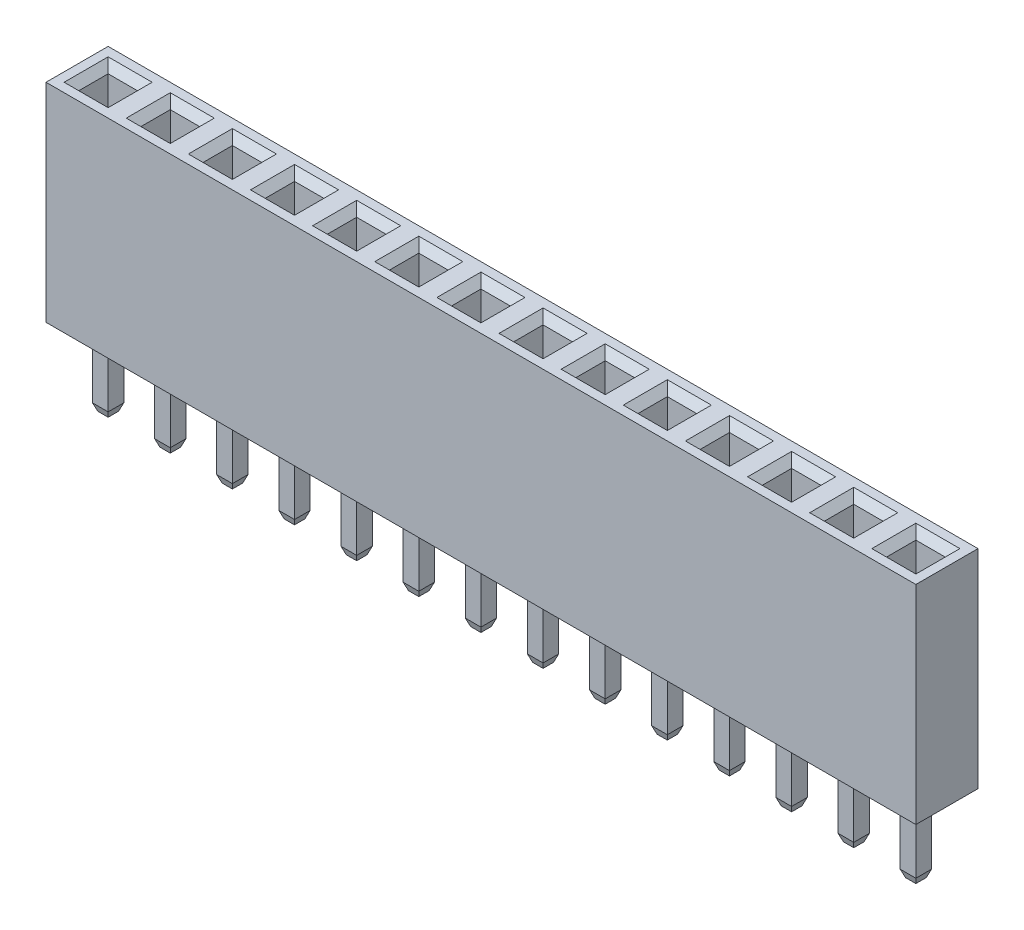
from build123d import *
from OCP.BRepFilletAPI import BRepFilletAPI_MakeChamfer

# Parameters (mm, degrees)
SKETCH_2_W                          = 2.54
SKETCH_2_H                          = 2.54
EXTRUDE_2_DEPTH                     = 8.5
SKETCH_3_W                          = 1.2
SKETCH_3_H                          = 1.2
CUT_EXTRUDE_1_DEPTH                 = 6.2
CHAMFER_3_SIZE                      = 0.3
SKETCH_1_W                          = 0.64
SKETCH_1_H                          = 0.64
EXTRUDE_1_DEPTH                     = 3.15
CHAMFER_1_SIZE                      = 0.3
CHAMFER_1_SIZE2                     = 0.10919107
PATTERN_LINEAR_1_COUNT              = 14
PATTERN_LINEAR_1_PITCH              = 2.54
CHAMFER_3_OF_PATTERN_LINEAR_1_SIZE  = 0.3
PATTERN_LINEAR_2_COUNT              = 60
PATTERN_LINEAR_2_PITCH              = 2.54
CHAMFER_1_OF_PATTERN_LINEAR_2_SIZE  = 0.3
CHAMFER_1_OF_PATTERN_LINEAR_2_SIZE2 = 0.10919107


with BuildPart() as part:
    # Sketch 2 → Extrude 2 (new body)
    with BuildSketch(Plane(origin=(0, 0, 0), x_dir=(1, 0, 0), z_dir=(0, 1, 0))):
        Rectangle(SKETCH_2_W, SKETCH_2_H)
    extrude_2 = extrude(amount=EXTRUDE_2_DEPTH)

    # Sketch 3 → Cut-Extrude 1 (cut)
    with BuildSketch(Plane(origin=(0, 8.5, 0), x_dir=(-1, 0, 0), z_dir=(0, 1, 0))):
        Rectangle(SKETCH_3_W, SKETCH_3_H)
    cut_extrude_1 = extrude(amount=-CUT_EXTRUDE_1_DEPTH, mode=Mode.SUBTRACT)

    # Chamfer 3
    chamfer_3_edges = [part.edges().sort_by_distance(p)[0] for p in [
        (-0.6, 8.5, 0),
        (0, 8.5, 0.6),
        (0.6, 8.5, 0),
        (0, 8.5, -0.6),
    ]]
    chamfer(chamfer_3_edges, length=CHAMFER_3_SIZE)

    # Sketch 1 → Extrude 1 (add)
    with BuildSketch(Plane(origin=(0, 0, 0), x_dir=(1, 0, 0), z_dir=(0, 1, 0))):
        Rectangle(SKETCH_1_W, SKETCH_1_H)
    extrude_1 = extrude(amount=-EXTRUDE_1_DEPTH)

    # Chamfer 1: one chamfer whose edges measure the first distance from different faces: ONE call of the kernel's chamfer builder (chamfer() names one face for all edges)
    chamfer_1_edges_1 = [part.edges().sort_by_distance(p)[0] for p in [
        (-0.32, -3.15, 0),
    ]]
    chamfer_1_side_1 = [part.faces().sort_by_distance(p)[0] for p in [
        (-0.32, -1.575, 0),
    ]]
    chamfer_1_edges_2 = [part.edges().sort_by_distance(p)[0] for p in [
        (0, -3.15, -0.32),
    ]]
    chamfer_1_side_2 = [part.faces().sort_by_distance(p)[0] for p in [
        (0, -1.575, -0.32),
    ]]
    chamfer_1_edges_3 = [part.edges().sort_by_distance(p)[0] for p in [
        (0.32, -3.15, 0),
    ]]
    chamfer_1_side_3 = [part.faces().sort_by_distance(p)[0] for p in [
        (0.32, -1.575, 0),
    ]]
    chamfer_1_edges_4 = [part.edges().sort_by_distance(p)[0] for p in [
        (0, -3.15, 0.32),
    ]]
    chamfer_1_side_4 = [part.faces().sort_by_distance(p)[0] for p in [
        (0, -1.575, 0.32),
    ]]
    chamfer_1 = BRepFilletAPI_MakeChamfer(part.part.solid().wrapped)
    for e in chamfer_1_edges_1:
        chamfer_1.Add(CHAMFER_1_SIZE, CHAMFER_1_SIZE2, e.wrapped, chamfer_1_side_1[0].wrapped)  # the first distance lies on this face
    for e in chamfer_1_edges_2:
        chamfer_1.Add(CHAMFER_1_SIZE, CHAMFER_1_SIZE2, e.wrapped, chamfer_1_side_2[0].wrapped)  # the first distance lies on this face
    for e in chamfer_1_edges_3:
        chamfer_1.Add(CHAMFER_1_SIZE, CHAMFER_1_SIZE2, e.wrapped, chamfer_1_side_3[0].wrapped)  # the first distance lies on this face
    for e in chamfer_1_edges_4:
        chamfer_1.Add(CHAMFER_1_SIZE, CHAMFER_1_SIZE2, e.wrapped, chamfer_1_side_4[0].wrapped)  # the first distance lies on this face
    add(Compound.cast(chamfer_1.Shape()), mode=Mode.REPLACE)

    # Pattern Linear 1: Extrude 2, Cut-Extrude 1 ×14
    with Locations(*[(-i * PATTERN_LINEAR_1_PITCH, 0, 0) for i in range(1, PATTERN_LINEAR_1_COUNT)]):
        add(extrude_2)
        add(cut_extrude_1, mode=Mode.SUBTRACT)

    # Chamfer 3 of Pattern Linear 1
    chamfer_3_of_pattern_linear_1_edges = [part.edges().sort_by_distance(p)[0] for p in [
        (-3.14, 8.5, 0),
        (-2.54, 8.5, 0.6),
        (-1.94, 8.5, 0),
        (-2.54, 8.5, -0.6),
        (-5.68, 8.5, 0),
        (-5.08, 8.5, 0.6),
        (-4.48, 8.5, 0),
        (-5.08, 8.5, -0.6),
        (-8.22, 8.5, 0),
        (-7.62, 8.5, 0.6),
        (-7.02, 8.5, 0),
        (-7.62, 8.5, -0.6),
        (-10.76, 8.5, 0),
        (-10.16, 8.5, 0.6),
        (-9.56, 8.5, 0),
        (-10.16, 8.5, -0.6),
        (-13.3, 8.5, 0),
        (-12.7, 8.5, 0.6),
        (-12.1, 8.5, 0),
        (-12.7, 8.5, -0.6),
        (-15.84, 8.5, 0),
        (-15.24, 8.5, 0.6),
        (-14.64, 8.5, 0),
        (-15.24, 8.5, -0.6),
        (-18.38, 8.5, 0),
        (-17.78, 8.5, 0.6),
        (-17.18, 8.5, 0),
        (-17.78, 8.5, -0.6),
        (-20.92, 8.5, 0),
        (-20.32, 8.5, 0.6),
        (-19.72, 8.5, 0),
        (-20.32, 8.5, -0.6),
        (-23.46, 8.5, 0),
        (-22.86, 8.5, 0.6),
        (-22.26, 8.5, 0),
        (-22.86, 8.5, -0.6),
        (-26, 8.5, 0),
        (-25.4, 8.5, 0.6),
        (-24.8, 8.5, 0),
        (-25.4, 8.5, -0.6),
        (-28.54, 8.5, 0),
        (-27.94, 8.5, 0.6),
        (-27.34, 8.5, 0),
        (-27.94, 8.5, -0.6),
        (-31.08, 8.5, 0),
        (-30.48, 8.5, 0.6),
        (-29.88, 8.5, 0),
        (-30.48, 8.5, -0.6),
        (-33.62, 8.5, 0),
        (-33.02, 8.5, 0.6),
        (-32.42, 8.5, 0),
        (-33.02, 8.5, -0.6),
    ]]
    chamfer(chamfer_3_of_pattern_linear_1_edges, length=CHAMFER_3_OF_PATTERN_LINEAR_1_SIZE)

    # Pattern Linear 2: Extrude 1 ×60, 46 skipped
    with Locations(*[(-i * PATTERN_LINEAR_2_PITCH, 0, 0) for i in range(1, PATTERN_LINEAR_2_COUNT) if i not in (14, 15, 16, 17, 18, 19, 20, 21, 22, 23, 24, 25, 26, 27, 28, 29, 30, 31, 32, 33, 34, 35, 36, 37, 38, 39, 40, 41, 42, 43, 44, 45, 46, 47, 48, 49, 50, 51, 52, 53, 54, 55, 56, 57, 58, 59)]):
        add(extrude_1)

    # Chamfer 1 of Pattern Linear 2: one chamfer whose edges measure the first distance from different faces: ONE call of the kernel's chamfer builder (chamfer() names one face for all edges)
    chamfer_1_of_pattern_linear_2_edges_1 = [part.edges().sort_by_distance(p)[0] for p in [
        (-2.86, -3.15, 0),
    ]]
    chamfer_1_of_pattern_linear_2_side_1 = [part.faces().sort_by_distance(p)[0] for p in [
        (-2.86, -1.575, 0),
    ]]
    chamfer_1_of_pattern_linear_2_edges_2 = [part.edges().sort_by_distance(p)[0] for p in [
        (-2.54, -3.15, -0.32),
    ]]
    chamfer_1_of_pattern_linear_2_side_2 = [part.faces().sort_by_distance(p)[0] for p in [
        (-2.54, -1.575, -0.32),
    ]]
    chamfer_1_of_pattern_linear_2_edges_3 = [part.edges().sort_by_distance(p)[0] for p in [
        (-2.22, -3.15, 0),
    ]]
    chamfer_1_of_pattern_linear_2_side_3 = [part.faces().sort_by_distance(p)[0] for p in [
        (-2.22, -1.575, 0),
    ]]
    chamfer_1_of_pattern_linear_2_edges_4 = [part.edges().sort_by_distance(p)[0] for p in [
        (-2.54, -3.15, 0.32),
    ]]
    chamfer_1_of_pattern_linear_2_side_4 = [part.faces().sort_by_distance(p)[0] for p in [
        (-2.54, -1.575, 0.32),
    ]]
    chamfer_1_of_pattern_linear_2_edges_5 = [part.edges().sort_by_distance(p)[0] for p in [
        (-5.4, -3.15, 0),
    ]]
    chamfer_1_of_pattern_linear_2_side_5 = [part.faces().sort_by_distance(p)[0] for p in [
        (-5.4, -1.575, 0),
    ]]
    chamfer_1_of_pattern_linear_2_edges_6 = [part.edges().sort_by_distance(p)[0] for p in [
        (-5.08, -3.15, -0.32),
    ]]
    chamfer_1_of_pattern_linear_2_side_6 = [part.faces().sort_by_distance(p)[0] for p in [
        (-5.08, -1.575, -0.32),
    ]]
    chamfer_1_of_pattern_linear_2_edges_7 = [part.edges().sort_by_distance(p)[0] for p in [
        (-4.76, -3.15, 0),
    ]]
    chamfer_1_of_pattern_linear_2_side_7 = [part.faces().sort_by_distance(p)[0] for p in [
        (-4.76, -1.575, 0),
    ]]
    chamfer_1_of_pattern_linear_2_edges_8 = [part.edges().sort_by_distance(p)[0] for p in [
        (-5.08, -3.15, 0.32),
    ]]
    chamfer_1_of_pattern_linear_2_side_8 = [part.faces().sort_by_distance(p)[0] for p in [
        (-5.08, -1.575, 0.32),
    ]]
    chamfer_1_of_pattern_linear_2_edges_9 = [part.edges().sort_by_distance(p)[0] for p in [
        (-7.94, -3.15, 0),
    ]]
    chamfer_1_of_pattern_linear_2_side_9 = [part.faces().sort_by_distance(p)[0] for p in [
        (-7.94, -1.575, 0),
    ]]
    chamfer_1_of_pattern_linear_2_edges_10 = [part.edges().sort_by_distance(p)[0] for p in [
        (-7.62, -3.15, -0.32),
    ]]
    chamfer_1_of_pattern_linear_2_side_10 = [part.faces().sort_by_distance(p)[0] for p in [
        (-7.62, -1.575, -0.32),
    ]]
    chamfer_1_of_pattern_linear_2_edges_11 = [part.edges().sort_by_distance(p)[0] for p in [
        (-7.3, -3.15, 0),
    ]]
    chamfer_1_of_pattern_linear_2_side_11 = [part.faces().sort_by_distance(p)[0] for p in [
        (-7.3, -1.575, 0),
    ]]
    chamfer_1_of_pattern_linear_2_edges_12 = [part.edges().sort_by_distance(p)[0] for p in [
        (-7.62, -3.15, 0.32),
    ]]
    chamfer_1_of_pattern_linear_2_side_12 = [part.faces().sort_by_distance(p)[0] for p in [
        (-7.62, -1.575, 0.32),
    ]]
    chamfer_1_of_pattern_linear_2_edges_13 = [part.edges().sort_by_distance(p)[0] for p in [
        (-10.48, -3.15, 0),
    ]]
    chamfer_1_of_pattern_linear_2_side_13 = [part.faces().sort_by_distance(p)[0] for p in [
        (-10.48, -1.575, 0),
    ]]
    chamfer_1_of_pattern_linear_2_edges_14 = [part.edges().sort_by_distance(p)[0] for p in [
        (-10.16, -3.15, -0.32),
    ]]
    chamfer_1_of_pattern_linear_2_side_14 = [part.faces().sort_by_distance(p)[0] for p in [
        (-10.16, -1.575, -0.32),
    ]]
    chamfer_1_of_pattern_linear_2_edges_15 = [part.edges().sort_by_distance(p)[0] for p in [
        (-9.84, -3.15, 0),
    ]]
    chamfer_1_of_pattern_linear_2_side_15 = [part.faces().sort_by_distance(p)[0] for p in [
        (-9.84, -1.575, 0),
    ]]
    chamfer_1_of_pattern_linear_2_edges_16 = [part.edges().sort_by_distance(p)[0] for p in [
        (-10.16, -3.15, 0.32),
    ]]
    chamfer_1_of_pattern_linear_2_side_16 = [part.faces().sort_by_distance(p)[0] for p in [
        (-10.16, -1.575, 0.32),
    ]]
    chamfer_1_of_pattern_linear_2_edges_17 = [part.edges().sort_by_distance(p)[0] for p in [
        (-13.02, -3.15, 0),
    ]]
    chamfer_1_of_pattern_linear_2_side_17 = [part.faces().sort_by_distance(p)[0] for p in [
        (-13.02, -1.575, 0),
    ]]
    chamfer_1_of_pattern_linear_2_edges_18 = [part.edges().sort_by_distance(p)[0] for p in [
        (-12.7, -3.15, -0.32),
    ]]
    chamfer_1_of_pattern_linear_2_side_18 = [part.faces().sort_by_distance(p)[0] for p in [
        (-12.7, -1.575, -0.32),
    ]]
    chamfer_1_of_pattern_linear_2_edges_19 = [part.edges().sort_by_distance(p)[0] for p in [
        (-12.38, -3.15, 0),
    ]]
    chamfer_1_of_pattern_linear_2_side_19 = [part.faces().sort_by_distance(p)[0] for p in [
        (-12.38, -1.575, 0),
    ]]
    chamfer_1_of_pattern_linear_2_edges_20 = [part.edges().sort_by_distance(p)[0] for p in [
        (-12.7, -3.15, 0.32),
    ]]
    chamfer_1_of_pattern_linear_2_side_20 = [part.faces().sort_by_distance(p)[0] for p in [
        (-12.7, -1.575, 0.32),
    ]]
    chamfer_1_of_pattern_linear_2_edges_21 = [part.edges().sort_by_distance(p)[0] for p in [
        (-15.56, -3.15, 0),
    ]]
    chamfer_1_of_pattern_linear_2_side_21 = [part.faces().sort_by_distance(p)[0] for p in [
        (-15.56, -1.575, 0),
    ]]
    chamfer_1_of_pattern_linear_2_edges_22 = [part.edges().sort_by_distance(p)[0] for p in [
        (-15.24, -3.15, -0.32),
    ]]
    chamfer_1_of_pattern_linear_2_side_22 = [part.faces().sort_by_distance(p)[0] for p in [
        (-15.24, -1.575, -0.32),
    ]]
    chamfer_1_of_pattern_linear_2_edges_23 = [part.edges().sort_by_distance(p)[0] for p in [
        (-14.92, -3.15, 0),
    ]]
    chamfer_1_of_pattern_linear_2_side_23 = [part.faces().sort_by_distance(p)[0] for p in [
        (-14.92, -1.575, 0),
    ]]
    chamfer_1_of_pattern_linear_2_edges_24 = [part.edges().sort_by_distance(p)[0] for p in [
        (-15.24, -3.15, 0.32),
    ]]
    chamfer_1_of_pattern_linear_2_side_24 = [part.faces().sort_by_distance(p)[0] for p in [
        (-15.24, -1.575, 0.32),
    ]]
    chamfer_1_of_pattern_linear_2_edges_25 = [part.edges().sort_by_distance(p)[0] for p in [
        (-18.1, -3.15, 0),
    ]]
    chamfer_1_of_pattern_linear_2_side_25 = [part.faces().sort_by_distance(p)[0] for p in [
        (-18.1, -1.575, 0),
    ]]
    chamfer_1_of_pattern_linear_2_edges_26 = [part.edges().sort_by_distance(p)[0] for p in [
        (-17.78, -3.15, -0.32),
    ]]
    chamfer_1_of_pattern_linear_2_side_26 = [part.faces().sort_by_distance(p)[0] for p in [
        (-17.78, -1.575, -0.32),
    ]]
    chamfer_1_of_pattern_linear_2_edges_27 = [part.edges().sort_by_distance(p)[0] for p in [
        (-17.46, -3.15, 0),
    ]]
    chamfer_1_of_pattern_linear_2_side_27 = [part.faces().sort_by_distance(p)[0] for p in [
        (-17.46, -1.575, 0),
    ]]
    chamfer_1_of_pattern_linear_2_edges_28 = [part.edges().sort_by_distance(p)[0] for p in [
        (-17.78, -3.15, 0.32),
    ]]
    chamfer_1_of_pattern_linear_2_side_28 = [part.faces().sort_by_distance(p)[0] for p in [
        (-17.78, -1.575, 0.32),
    ]]
    chamfer_1_of_pattern_linear_2_edges_29 = [part.edges().sort_by_distance(p)[0] for p in [
        (-20.64, -3.15, 0),
    ]]
    chamfer_1_of_pattern_linear_2_side_29 = [part.faces().sort_by_distance(p)[0] for p in [
        (-20.64, -1.575, 0),
    ]]
    chamfer_1_of_pattern_linear_2_edges_30 = [part.edges().sort_by_distance(p)[0] for p in [
        (-20.32, -3.15, -0.32),
    ]]
    chamfer_1_of_pattern_linear_2_side_30 = [part.faces().sort_by_distance(p)[0] for p in [
        (-20.32, -1.575, -0.32),
    ]]
    chamfer_1_of_pattern_linear_2_edges_31 = [part.edges().sort_by_distance(p)[0] for p in [
        (-20, -3.15, 0),
    ]]
    chamfer_1_of_pattern_linear_2_side_31 = [part.faces().sort_by_distance(p)[0] for p in [
        (-20, -1.575, 0),
    ]]
    chamfer_1_of_pattern_linear_2_edges_32 = [part.edges().sort_by_distance(p)[0] for p in [
        (-20.32, -3.15, 0.32),
    ]]
    chamfer_1_of_pattern_linear_2_side_32 = [part.faces().sort_by_distance(p)[0] for p in [
        (-20.32, -1.575, 0.32),
    ]]
    chamfer_1_of_pattern_linear_2_edges_33 = [part.edges().sort_by_distance(p)[0] for p in [
        (-23.18, -3.15, 0),
    ]]
    chamfer_1_of_pattern_linear_2_side_33 = [part.faces().sort_by_distance(p)[0] for p in [
        (-23.18, -1.575, 0),
    ]]
    chamfer_1_of_pattern_linear_2_edges_34 = [part.edges().sort_by_distance(p)[0] for p in [
        (-22.86, -3.15, -0.32),
    ]]
    chamfer_1_of_pattern_linear_2_side_34 = [part.faces().sort_by_distance(p)[0] for p in [
        (-22.86, -1.575, -0.32),
    ]]
    chamfer_1_of_pattern_linear_2_edges_35 = [part.edges().sort_by_distance(p)[0] for p in [
        (-22.54, -3.15, 0),
    ]]
    chamfer_1_of_pattern_linear_2_side_35 = [part.faces().sort_by_distance(p)[0] for p in [
        (-22.54, -1.575, 0),
    ]]
    chamfer_1_of_pattern_linear_2_edges_36 = [part.edges().sort_by_distance(p)[0] for p in [
        (-22.86, -3.15, 0.32),
    ]]
    chamfer_1_of_pattern_linear_2_side_36 = [part.faces().sort_by_distance(p)[0] for p in [
        (-22.86, -1.575, 0.32),
    ]]
    chamfer_1_of_pattern_linear_2_edges_37 = [part.edges().sort_by_distance(p)[0] for p in [
        (-25.72, -3.15, 0),
    ]]
    chamfer_1_of_pattern_linear_2_side_37 = [part.faces().sort_by_distance(p)[0] for p in [
        (-25.72, -1.575, 0),
    ]]
    chamfer_1_of_pattern_linear_2_edges_38 = [part.edges().sort_by_distance(p)[0] for p in [
        (-25.4, -3.15, -0.32),
    ]]
    chamfer_1_of_pattern_linear_2_side_38 = [part.faces().sort_by_distance(p)[0] for p in [
        (-25.4, -1.575, -0.32),
    ]]
    chamfer_1_of_pattern_linear_2_edges_39 = [part.edges().sort_by_distance(p)[0] for p in [
        (-25.08, -3.15, 0),
    ]]
    chamfer_1_of_pattern_linear_2_side_39 = [part.faces().sort_by_distance(p)[0] for p in [
        (-25.08, -1.575, 0),
    ]]
    chamfer_1_of_pattern_linear_2_edges_40 = [part.edges().sort_by_distance(p)[0] for p in [
        (-25.4, -3.15, 0.32),
    ]]
    chamfer_1_of_pattern_linear_2_side_40 = [part.faces().sort_by_distance(p)[0] for p in [
        (-25.4, -1.575, 0.32),
    ]]
    chamfer_1_of_pattern_linear_2_edges_41 = [part.edges().sort_by_distance(p)[0] for p in [
        (-28.26, -3.15, 0),
    ]]
    chamfer_1_of_pattern_linear_2_side_41 = [part.faces().sort_by_distance(p)[0] for p in [
        (-28.26, -1.575, 0),
    ]]
    chamfer_1_of_pattern_linear_2_edges_42 = [part.edges().sort_by_distance(p)[0] for p in [
        (-27.94, -3.15, -0.32),
    ]]
    chamfer_1_of_pattern_linear_2_side_42 = [part.faces().sort_by_distance(p)[0] for p in [
        (-27.94, -1.575, -0.32),
    ]]
    chamfer_1_of_pattern_linear_2_edges_43 = [part.edges().sort_by_distance(p)[0] for p in [
        (-27.62, -3.15, 0),
    ]]
    chamfer_1_of_pattern_linear_2_side_43 = [part.faces().sort_by_distance(p)[0] for p in [
        (-27.62, -1.575, 0),
    ]]
    chamfer_1_of_pattern_linear_2_edges_44 = [part.edges().sort_by_distance(p)[0] for p in [
        (-27.94, -3.15, 0.32),
    ]]
    chamfer_1_of_pattern_linear_2_side_44 = [part.faces().sort_by_distance(p)[0] for p in [
        (-27.94, -1.575, 0.32),
    ]]
    chamfer_1_of_pattern_linear_2_edges_45 = [part.edges().sort_by_distance(p)[0] for p in [
        (-30.8, -3.15, 0),
    ]]
    chamfer_1_of_pattern_linear_2_side_45 = [part.faces().sort_by_distance(p)[0] for p in [
        (-30.8, -1.575, 0),
    ]]
    chamfer_1_of_pattern_linear_2_edges_46 = [part.edges().sort_by_distance(p)[0] for p in [
        (-30.48, -3.15, -0.32),
    ]]
    chamfer_1_of_pattern_linear_2_side_46 = [part.faces().sort_by_distance(p)[0] for p in [
        (-30.48, -1.575, -0.32),
    ]]
    chamfer_1_of_pattern_linear_2_edges_47 = [part.edges().sort_by_distance(p)[0] for p in [
        (-30.16, -3.15, 0),
    ]]
    chamfer_1_of_pattern_linear_2_side_47 = [part.faces().sort_by_distance(p)[0] for p in [
        (-30.16, -1.575, 0),
    ]]
    chamfer_1_of_pattern_linear_2_edges_48 = [part.edges().sort_by_distance(p)[0] for p in [
        (-30.48, -3.15, 0.32),
    ]]
    chamfer_1_of_pattern_linear_2_side_48 = [part.faces().sort_by_distance(p)[0] for p in [
        (-30.48, -1.575, 0.32),
    ]]
    chamfer_1_of_pattern_linear_2_edges_49 = [part.edges().sort_by_distance(p)[0] for p in [
        (-33.34, -3.15, 0),
    ]]
    chamfer_1_of_pattern_linear_2_side_49 = [part.faces().sort_by_distance(p)[0] for p in [
        (-33.34, -1.575, 0),
    ]]
    chamfer_1_of_pattern_linear_2_edges_50 = [part.edges().sort_by_distance(p)[0] for p in [
        (-33.02, -3.15, -0.32),
    ]]
    chamfer_1_of_pattern_linear_2_side_50 = [part.faces().sort_by_distance(p)[0] for p in [
        (-33.02, -1.575, -0.32),
    ]]
    chamfer_1_of_pattern_linear_2_edges_51 = [part.edges().sort_by_distance(p)[0] for p in [
        (-32.7, -3.15, 0),
    ]]
    chamfer_1_of_pattern_linear_2_side_51 = [part.faces().sort_by_distance(p)[0] for p in [
        (-32.7, -1.575, 0),
    ]]
    chamfer_1_of_pattern_linear_2_edges_52 = [part.edges().sort_by_distance(p)[0] for p in [
        (-33.02, -3.15, 0.32),
    ]]
    chamfer_1_of_pattern_linear_2_side_52 = [part.faces().sort_by_distance(p)[0] for p in [
        (-33.02, -1.575, 0.32),
    ]]
    chamfer_1_of_pattern_linear_2 = BRepFilletAPI_MakeChamfer(part.part.solid().wrapped)
    for e in chamfer_1_of_pattern_linear_2_edges_1:
        chamfer_1_of_pattern_linear_2.Add(CHAMFER_1_OF_PATTERN_LINEAR_2_SIZE, CHAMFER_1_OF_PATTERN_LINEAR_2_SIZE2, e.wrapped, chamfer_1_of_pattern_linear_2_side_1[0].wrapped)  # the first distance lies on this face
    for e in chamfer_1_of_pattern_linear_2_edges_2:
        chamfer_1_of_pattern_linear_2.Add(CHAMFER_1_OF_PATTERN_LINEAR_2_SIZE, CHAMFER_1_OF_PATTERN_LINEAR_2_SIZE2, e.wrapped, chamfer_1_of_pattern_linear_2_side_2[0].wrapped)  # the first distance lies on this face
    for e in chamfer_1_of_pattern_linear_2_edges_3:
        chamfer_1_of_pattern_linear_2.Add(CHAMFER_1_OF_PATTERN_LINEAR_2_SIZE, CHAMFER_1_OF_PATTERN_LINEAR_2_SIZE2, e.wrapped, chamfer_1_of_pattern_linear_2_side_3[0].wrapped)  # the first distance lies on this face
    for e in chamfer_1_of_pattern_linear_2_edges_4:
        chamfer_1_of_pattern_linear_2.Add(CHAMFER_1_OF_PATTERN_LINEAR_2_SIZE, CHAMFER_1_OF_PATTERN_LINEAR_2_SIZE2, e.wrapped, chamfer_1_of_pattern_linear_2_side_4[0].wrapped)  # the first distance lies on this face
    for e in chamfer_1_of_pattern_linear_2_edges_5:
        chamfer_1_of_pattern_linear_2.Add(CHAMFER_1_OF_PATTERN_LINEAR_2_SIZE, CHAMFER_1_OF_PATTERN_LINEAR_2_SIZE2, e.wrapped, chamfer_1_of_pattern_linear_2_side_5[0].wrapped)  # the first distance lies on this face
    for e in chamfer_1_of_pattern_linear_2_edges_6:
        chamfer_1_of_pattern_linear_2.Add(CHAMFER_1_OF_PATTERN_LINEAR_2_SIZE, CHAMFER_1_OF_PATTERN_LINEAR_2_SIZE2, e.wrapped, chamfer_1_of_pattern_linear_2_side_6[0].wrapped)  # the first distance lies on this face
    for e in chamfer_1_of_pattern_linear_2_edges_7:
        chamfer_1_of_pattern_linear_2.Add(CHAMFER_1_OF_PATTERN_LINEAR_2_SIZE, CHAMFER_1_OF_PATTERN_LINEAR_2_SIZE2, e.wrapped, chamfer_1_of_pattern_linear_2_side_7[0].wrapped)  # the first distance lies on this face
    for e in chamfer_1_of_pattern_linear_2_edges_8:
        chamfer_1_of_pattern_linear_2.Add(CHAMFER_1_OF_PATTERN_LINEAR_2_SIZE, CHAMFER_1_OF_PATTERN_LINEAR_2_SIZE2, e.wrapped, chamfer_1_of_pattern_linear_2_side_8[0].wrapped)  # the first distance lies on this face
    for e in chamfer_1_of_pattern_linear_2_edges_9:
        chamfer_1_of_pattern_linear_2.Add(CHAMFER_1_OF_PATTERN_LINEAR_2_SIZE, CHAMFER_1_OF_PATTERN_LINEAR_2_SIZE2, e.wrapped, chamfer_1_of_pattern_linear_2_side_9[0].wrapped)  # the first distance lies on this face
    for e in chamfer_1_of_pattern_linear_2_edges_10:
        chamfer_1_of_pattern_linear_2.Add(CHAMFER_1_OF_PATTERN_LINEAR_2_SIZE, CHAMFER_1_OF_PATTERN_LINEAR_2_SIZE2, e.wrapped, chamfer_1_of_pattern_linear_2_side_10[0].wrapped)  # the first distance lies on this face
    for e in chamfer_1_of_pattern_linear_2_edges_11:
        chamfer_1_of_pattern_linear_2.Add(CHAMFER_1_OF_PATTERN_LINEAR_2_SIZE, CHAMFER_1_OF_PATTERN_LINEAR_2_SIZE2, e.wrapped, chamfer_1_of_pattern_linear_2_side_11[0].wrapped)  # the first distance lies on this face
    for e in chamfer_1_of_pattern_linear_2_edges_12:
        chamfer_1_of_pattern_linear_2.Add(CHAMFER_1_OF_PATTERN_LINEAR_2_SIZE, CHAMFER_1_OF_PATTERN_LINEAR_2_SIZE2, e.wrapped, chamfer_1_of_pattern_linear_2_side_12[0].wrapped)  # the first distance lies on this face
    for e in chamfer_1_of_pattern_linear_2_edges_13:
        chamfer_1_of_pattern_linear_2.Add(CHAMFER_1_OF_PATTERN_LINEAR_2_SIZE, CHAMFER_1_OF_PATTERN_LINEAR_2_SIZE2, e.wrapped, chamfer_1_of_pattern_linear_2_side_13[0].wrapped)  # the first distance lies on this face
    for e in chamfer_1_of_pattern_linear_2_edges_14:
        chamfer_1_of_pattern_linear_2.Add(CHAMFER_1_OF_PATTERN_LINEAR_2_SIZE, CHAMFER_1_OF_PATTERN_LINEAR_2_SIZE2, e.wrapped, chamfer_1_of_pattern_linear_2_side_14[0].wrapped)  # the first distance lies on this face
    for e in chamfer_1_of_pattern_linear_2_edges_15:
        chamfer_1_of_pattern_linear_2.Add(CHAMFER_1_OF_PATTERN_LINEAR_2_SIZE, CHAMFER_1_OF_PATTERN_LINEAR_2_SIZE2, e.wrapped, chamfer_1_of_pattern_linear_2_side_15[0].wrapped)  # the first distance lies on this face
    for e in chamfer_1_of_pattern_linear_2_edges_16:
        chamfer_1_of_pattern_linear_2.Add(CHAMFER_1_OF_PATTERN_LINEAR_2_SIZE, CHAMFER_1_OF_PATTERN_LINEAR_2_SIZE2, e.wrapped, chamfer_1_of_pattern_linear_2_side_16[0].wrapped)  # the first distance lies on this face
    for e in chamfer_1_of_pattern_linear_2_edges_17:
        chamfer_1_of_pattern_linear_2.Add(CHAMFER_1_OF_PATTERN_LINEAR_2_SIZE, CHAMFER_1_OF_PATTERN_LINEAR_2_SIZE2, e.wrapped, chamfer_1_of_pattern_linear_2_side_17[0].wrapped)  # the first distance lies on this face
    for e in chamfer_1_of_pattern_linear_2_edges_18:
        chamfer_1_of_pattern_linear_2.Add(CHAMFER_1_OF_PATTERN_LINEAR_2_SIZE, CHAMFER_1_OF_PATTERN_LINEAR_2_SIZE2, e.wrapped, chamfer_1_of_pattern_linear_2_side_18[0].wrapped)  # the first distance lies on this face
    for e in chamfer_1_of_pattern_linear_2_edges_19:
        chamfer_1_of_pattern_linear_2.Add(CHAMFER_1_OF_PATTERN_LINEAR_2_SIZE, CHAMFER_1_OF_PATTERN_LINEAR_2_SIZE2, e.wrapped, chamfer_1_of_pattern_linear_2_side_19[0].wrapped)  # the first distance lies on this face
    for e in chamfer_1_of_pattern_linear_2_edges_20:
        chamfer_1_of_pattern_linear_2.Add(CHAMFER_1_OF_PATTERN_LINEAR_2_SIZE, CHAMFER_1_OF_PATTERN_LINEAR_2_SIZE2, e.wrapped, chamfer_1_of_pattern_linear_2_side_20[0].wrapped)  # the first distance lies on this face
    for e in chamfer_1_of_pattern_linear_2_edges_21:
        chamfer_1_of_pattern_linear_2.Add(CHAMFER_1_OF_PATTERN_LINEAR_2_SIZE, CHAMFER_1_OF_PATTERN_LINEAR_2_SIZE2, e.wrapped, chamfer_1_of_pattern_linear_2_side_21[0].wrapped)  # the first distance lies on this face
    for e in chamfer_1_of_pattern_linear_2_edges_22:
        chamfer_1_of_pattern_linear_2.Add(CHAMFER_1_OF_PATTERN_LINEAR_2_SIZE, CHAMFER_1_OF_PATTERN_LINEAR_2_SIZE2, e.wrapped, chamfer_1_of_pattern_linear_2_side_22[0].wrapped)  # the first distance lies on this face
    for e in chamfer_1_of_pattern_linear_2_edges_23:
        chamfer_1_of_pattern_linear_2.Add(CHAMFER_1_OF_PATTERN_LINEAR_2_SIZE, CHAMFER_1_OF_PATTERN_LINEAR_2_SIZE2, e.wrapped, chamfer_1_of_pattern_linear_2_side_23[0].wrapped)  # the first distance lies on this face
    for e in chamfer_1_of_pattern_linear_2_edges_24:
        chamfer_1_of_pattern_linear_2.Add(CHAMFER_1_OF_PATTERN_LINEAR_2_SIZE, CHAMFER_1_OF_PATTERN_LINEAR_2_SIZE2, e.wrapped, chamfer_1_of_pattern_linear_2_side_24[0].wrapped)  # the first distance lies on this face
    for e in chamfer_1_of_pattern_linear_2_edges_25:
        chamfer_1_of_pattern_linear_2.Add(CHAMFER_1_OF_PATTERN_LINEAR_2_SIZE, CHAMFER_1_OF_PATTERN_LINEAR_2_SIZE2, e.wrapped, chamfer_1_of_pattern_linear_2_side_25[0].wrapped)  # the first distance lies on this face
    for e in chamfer_1_of_pattern_linear_2_edges_26:
        chamfer_1_of_pattern_linear_2.Add(CHAMFER_1_OF_PATTERN_LINEAR_2_SIZE, CHAMFER_1_OF_PATTERN_LINEAR_2_SIZE2, e.wrapped, chamfer_1_of_pattern_linear_2_side_26[0].wrapped)  # the first distance lies on this face
    for e in chamfer_1_of_pattern_linear_2_edges_27:
        chamfer_1_of_pattern_linear_2.Add(CHAMFER_1_OF_PATTERN_LINEAR_2_SIZE, CHAMFER_1_OF_PATTERN_LINEAR_2_SIZE2, e.wrapped, chamfer_1_of_pattern_linear_2_side_27[0].wrapped)  # the first distance lies on this face
    for e in chamfer_1_of_pattern_linear_2_edges_28:
        chamfer_1_of_pattern_linear_2.Add(CHAMFER_1_OF_PATTERN_LINEAR_2_SIZE, CHAMFER_1_OF_PATTERN_LINEAR_2_SIZE2, e.wrapped, chamfer_1_of_pattern_linear_2_side_28[0].wrapped)  # the first distance lies on this face
    for e in chamfer_1_of_pattern_linear_2_edges_29:
        chamfer_1_of_pattern_linear_2.Add(CHAMFER_1_OF_PATTERN_LINEAR_2_SIZE, CHAMFER_1_OF_PATTERN_LINEAR_2_SIZE2, e.wrapped, chamfer_1_of_pattern_linear_2_side_29[0].wrapped)  # the first distance lies on this face
    for e in chamfer_1_of_pattern_linear_2_edges_30:
        chamfer_1_of_pattern_linear_2.Add(CHAMFER_1_OF_PATTERN_LINEAR_2_SIZE, CHAMFER_1_OF_PATTERN_LINEAR_2_SIZE2, e.wrapped, chamfer_1_of_pattern_linear_2_side_30[0].wrapped)  # the first distance lies on this face
    for e in chamfer_1_of_pattern_linear_2_edges_31:
        chamfer_1_of_pattern_linear_2.Add(CHAMFER_1_OF_PATTERN_LINEAR_2_SIZE, CHAMFER_1_OF_PATTERN_LINEAR_2_SIZE2, e.wrapped, chamfer_1_of_pattern_linear_2_side_31[0].wrapped)  # the first distance lies on this face
    for e in chamfer_1_of_pattern_linear_2_edges_32:
        chamfer_1_of_pattern_linear_2.Add(CHAMFER_1_OF_PATTERN_LINEAR_2_SIZE, CHAMFER_1_OF_PATTERN_LINEAR_2_SIZE2, e.wrapped, chamfer_1_of_pattern_linear_2_side_32[0].wrapped)  # the first distance lies on this face
    for e in chamfer_1_of_pattern_linear_2_edges_33:
        chamfer_1_of_pattern_linear_2.Add(CHAMFER_1_OF_PATTERN_LINEAR_2_SIZE, CHAMFER_1_OF_PATTERN_LINEAR_2_SIZE2, e.wrapped, chamfer_1_of_pattern_linear_2_side_33[0].wrapped)  # the first distance lies on this face
    for e in chamfer_1_of_pattern_linear_2_edges_34:
        chamfer_1_of_pattern_linear_2.Add(CHAMFER_1_OF_PATTERN_LINEAR_2_SIZE, CHAMFER_1_OF_PATTERN_LINEAR_2_SIZE2, e.wrapped, chamfer_1_of_pattern_linear_2_side_34[0].wrapped)  # the first distance lies on this face
    for e in chamfer_1_of_pattern_linear_2_edges_35:
        chamfer_1_of_pattern_linear_2.Add(CHAMFER_1_OF_PATTERN_LINEAR_2_SIZE, CHAMFER_1_OF_PATTERN_LINEAR_2_SIZE2, e.wrapped, chamfer_1_of_pattern_linear_2_side_35[0].wrapped)  # the first distance lies on this face
    for e in chamfer_1_of_pattern_linear_2_edges_36:
        chamfer_1_of_pattern_linear_2.Add(CHAMFER_1_OF_PATTERN_LINEAR_2_SIZE, CHAMFER_1_OF_PATTERN_LINEAR_2_SIZE2, e.wrapped, chamfer_1_of_pattern_linear_2_side_36[0].wrapped)  # the first distance lies on this face
    for e in chamfer_1_of_pattern_linear_2_edges_37:
        chamfer_1_of_pattern_linear_2.Add(CHAMFER_1_OF_PATTERN_LINEAR_2_SIZE, CHAMFER_1_OF_PATTERN_LINEAR_2_SIZE2, e.wrapped, chamfer_1_of_pattern_linear_2_side_37[0].wrapped)  # the first distance lies on this face
    for e in chamfer_1_of_pattern_linear_2_edges_38:
        chamfer_1_of_pattern_linear_2.Add(CHAMFER_1_OF_PATTERN_LINEAR_2_SIZE, CHAMFER_1_OF_PATTERN_LINEAR_2_SIZE2, e.wrapped, chamfer_1_of_pattern_linear_2_side_38[0].wrapped)  # the first distance lies on this face
    for e in chamfer_1_of_pattern_linear_2_edges_39:
        chamfer_1_of_pattern_linear_2.Add(CHAMFER_1_OF_PATTERN_LINEAR_2_SIZE, CHAMFER_1_OF_PATTERN_LINEAR_2_SIZE2, e.wrapped, chamfer_1_of_pattern_linear_2_side_39[0].wrapped)  # the first distance lies on this face
    for e in chamfer_1_of_pattern_linear_2_edges_40:
        chamfer_1_of_pattern_linear_2.Add(CHAMFER_1_OF_PATTERN_LINEAR_2_SIZE, CHAMFER_1_OF_PATTERN_LINEAR_2_SIZE2, e.wrapped, chamfer_1_of_pattern_linear_2_side_40[0].wrapped)  # the first distance lies on this face
    for e in chamfer_1_of_pattern_linear_2_edges_41:
        chamfer_1_of_pattern_linear_2.Add(CHAMFER_1_OF_PATTERN_LINEAR_2_SIZE, CHAMFER_1_OF_PATTERN_LINEAR_2_SIZE2, e.wrapped, chamfer_1_of_pattern_linear_2_side_41[0].wrapped)  # the first distance lies on this face
    for e in chamfer_1_of_pattern_linear_2_edges_42:
        chamfer_1_of_pattern_linear_2.Add(CHAMFER_1_OF_PATTERN_LINEAR_2_SIZE, CHAMFER_1_OF_PATTERN_LINEAR_2_SIZE2, e.wrapped, chamfer_1_of_pattern_linear_2_side_42[0].wrapped)  # the first distance lies on this face
    for e in chamfer_1_of_pattern_linear_2_edges_43:
        chamfer_1_of_pattern_linear_2.Add(CHAMFER_1_OF_PATTERN_LINEAR_2_SIZE, CHAMFER_1_OF_PATTERN_LINEAR_2_SIZE2, e.wrapped, chamfer_1_of_pattern_linear_2_side_43[0].wrapped)  # the first distance lies on this face
    for e in chamfer_1_of_pattern_linear_2_edges_44:
        chamfer_1_of_pattern_linear_2.Add(CHAMFER_1_OF_PATTERN_LINEAR_2_SIZE, CHAMFER_1_OF_PATTERN_LINEAR_2_SIZE2, e.wrapped, chamfer_1_of_pattern_linear_2_side_44[0].wrapped)  # the first distance lies on this face
    for e in chamfer_1_of_pattern_linear_2_edges_45:
        chamfer_1_of_pattern_linear_2.Add(CHAMFER_1_OF_PATTERN_LINEAR_2_SIZE, CHAMFER_1_OF_PATTERN_LINEAR_2_SIZE2, e.wrapped, chamfer_1_of_pattern_linear_2_side_45[0].wrapped)  # the first distance lies on this face
    for e in chamfer_1_of_pattern_linear_2_edges_46:
        chamfer_1_of_pattern_linear_2.Add(CHAMFER_1_OF_PATTERN_LINEAR_2_SIZE, CHAMFER_1_OF_PATTERN_LINEAR_2_SIZE2, e.wrapped, chamfer_1_of_pattern_linear_2_side_46[0].wrapped)  # the first distance lies on this face
    for e in chamfer_1_of_pattern_linear_2_edges_47:
        chamfer_1_of_pattern_linear_2.Add(CHAMFER_1_OF_PATTERN_LINEAR_2_SIZE, CHAMFER_1_OF_PATTERN_LINEAR_2_SIZE2, e.wrapped, chamfer_1_of_pattern_linear_2_side_47[0].wrapped)  # the first distance lies on this face
    for e in chamfer_1_of_pattern_linear_2_edges_48:
        chamfer_1_of_pattern_linear_2.Add(CHAMFER_1_OF_PATTERN_LINEAR_2_SIZE, CHAMFER_1_OF_PATTERN_LINEAR_2_SIZE2, e.wrapped, chamfer_1_of_pattern_linear_2_side_48[0].wrapped)  # the first distance lies on this face
    for e in chamfer_1_of_pattern_linear_2_edges_49:
        chamfer_1_of_pattern_linear_2.Add(CHAMFER_1_OF_PATTERN_LINEAR_2_SIZE, CHAMFER_1_OF_PATTERN_LINEAR_2_SIZE2, e.wrapped, chamfer_1_of_pattern_linear_2_side_49[0].wrapped)  # the first distance lies on this face
    for e in chamfer_1_of_pattern_linear_2_edges_50:
        chamfer_1_of_pattern_linear_2.Add(CHAMFER_1_OF_PATTERN_LINEAR_2_SIZE, CHAMFER_1_OF_PATTERN_LINEAR_2_SIZE2, e.wrapped, chamfer_1_of_pattern_linear_2_side_50[0].wrapped)  # the first distance lies on this face
    for e in chamfer_1_of_pattern_linear_2_edges_51:
        chamfer_1_of_pattern_linear_2.Add(CHAMFER_1_OF_PATTERN_LINEAR_2_SIZE, CHAMFER_1_OF_PATTERN_LINEAR_2_SIZE2, e.wrapped, chamfer_1_of_pattern_linear_2_side_51[0].wrapped)  # the first distance lies on this face
    for e in chamfer_1_of_pattern_linear_2_edges_52:
        chamfer_1_of_pattern_linear_2.Add(CHAMFER_1_OF_PATTERN_LINEAR_2_SIZE, CHAMFER_1_OF_PATTERN_LINEAR_2_SIZE2, e.wrapped, chamfer_1_of_pattern_linear_2_side_52[0].wrapped)  # the first distance lies on this face
    add(Compound.cast(chamfer_1_of_pattern_linear_2.Shape()), mode=Mode.REPLACE)


solid = part.part
